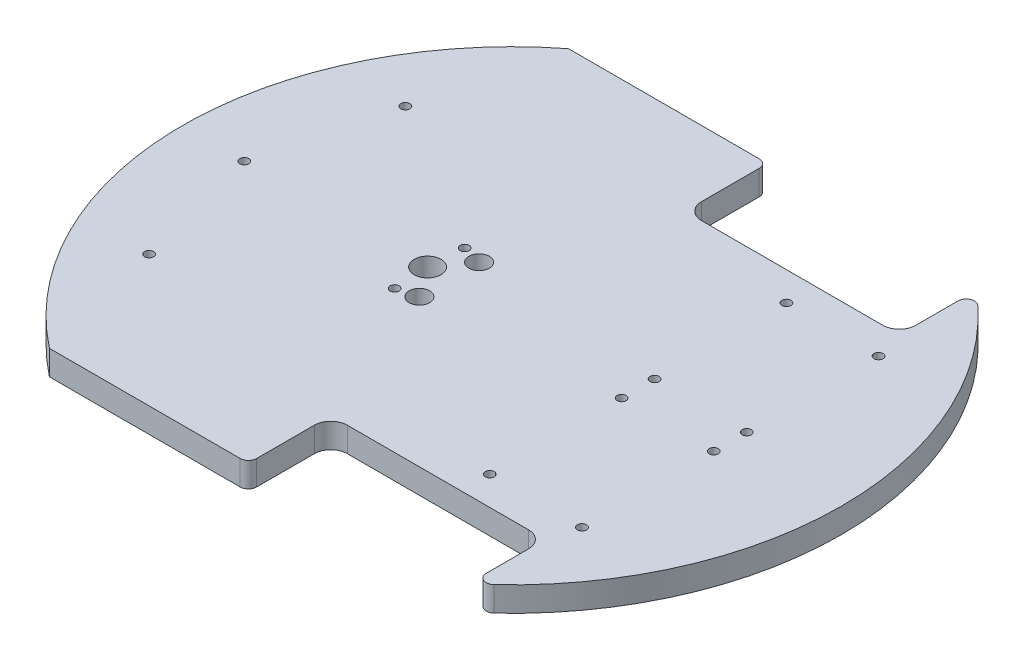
from build123d import *

# Parameters (mm, degrees)
ESQUISSE1_R      = 1.1
ESQUISSE1_R_2    = 2.5
ESQUISSE1_R_3    = 3.25
EXTRUSION1_DEPTH = 6


with BuildPart() as part:
    # Esquisse1 → Extrusion1 (new body)
    with BuildSketch(Plane(origin=(0, 0, 0), x_dir=(1, 0, 0), z_dir=(0, 1, 0))):
        with BuildLine():
            Line((-64.305172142, -63), (-18, -63))
            ThreePointArc((-18, -63), (-16.585786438, -62.414213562), (-16, -61))
            Line((-16, -61), (-16, -47))
            ThreePointArc((-16, -47), (-14.828427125, -44.171572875), (-12, -43))
            Line((-12, -43), (32, -43))
            ThreePointArc((32, -43), (34.828427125, -44.171572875), (36, -47))
            Line((36, -47), (36, -57.227615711))
            ThreePointArc((36, -57.227615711), (37.199359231, -59.060366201), (39.358974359, -58.694990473))
            ThreePointArc((39.358974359, -58.694990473), (65, 0), (39.358974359, 58.694990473))
            ThreePointArc((39.358974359, 58.694990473), (37.199359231, 59.060366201), (36, 57.227615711))
            Line((36, 57.227615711), (36, 47))
            ThreePointArc((36, 47), (34.828427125, 44.171572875), (32, 43))
            Line((32, 43), (-12, 43))
            ThreePointArc((-12, 43), (-14.828427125, 44.171572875), (-16, 47))
            Line((-16, 47), (-16, 61))
            ThreePointArc((-16, 61), (-16.585786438, 62.414213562), (-18, 63))
            Line((-18, 63), (-64.305172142, 63))
            ThreePointArc((-64.305172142, 63), (-95, 0), (-64.305172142, -63))
        make_face()
        with Locations(Location((15.6, -4, 0), (0, 0, 270))):
            Circle(ESQUISSE1_R, mode=Mode.SUBTRACT)
        with Locations(Location((37.959035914, -4, 0), (0, 0, 270))):
            Circle(ESQUISSE1_R, mode=Mode.SUBTRACT)
        with Locations(Location((37.959035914, -36, 0), (0, 0, 90))):
            Circle(ESQUISSE1_R, mode=Mode.SUBTRACT)
        with Locations(Location((15.6, -36, 0), (0, 0, 90))):
            Circle(ESQUISSE1_R, mode=Mode.SUBTRACT)
        with Locations(Location((37.959035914, 4, 0), (0, 0, 90))):
            Circle(ESQUISSE1_R, mode=Mode.SUBTRACT)
        with Locations(Location((37.959035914, 36, 0), (0, 0, 270))):
            Circle(ESQUISSE1_R, mode=Mode.SUBTRACT)
        with Locations(Location((15.6, 36, 0), (0, 0, 270))):
            Circle(ESQUISSE1_R, mode=Mode.SUBTRACT)
        with Locations(Location((15.6, 4, 0), (0, 0, 90))):
            Circle(ESQUISSE1_R, mode=Mode.SUBTRACT)
        with Locations(Location((-35, -8.5, 0), (0, 0, 90))):
            Circle(ESQUISSE1_R, mode=Mode.SUBTRACT)
        with Locations(Location((-30.25, 7.25, 0), (0, 0, 90))):
            Circle(ESQUISSE1_R_2, mode=Mode.SUBTRACT)
        with Locations(Location((-72, -31.1, 0), (0, 0, 90))):
            Circle(ESQUISSE1_R, mode=Mode.SUBTRACT)
        with Locations(Location((-72, 31.1, 0), (0, 0, 270))):
            Circle(ESQUISSE1_R, mode=Mode.SUBTRACT)
        with Locations(Location((-80, 0, 0), (0, 0, 270))):
            Circle(ESQUISSE1_R, mode=Mode.SUBTRACT)
        with Locations(Location((-35, 8.5, 0), (0, 0, 270))):
            Circle(ESQUISSE1_R, mode=Mode.SUBTRACT)
        with Locations(Location((-35.5, 0, 0), (0, 0, 270))):
            Circle(ESQUISSE1_R_3, mode=Mode.SUBTRACT)
        with Locations(Location((-30.25, -7.25, 0), (0, 0, 270))):
            Circle(ESQUISSE1_R_2, mode=Mode.SUBTRACT)
    extrude(amount=EXTRUSION1_DEPTH)


solid = part.part
